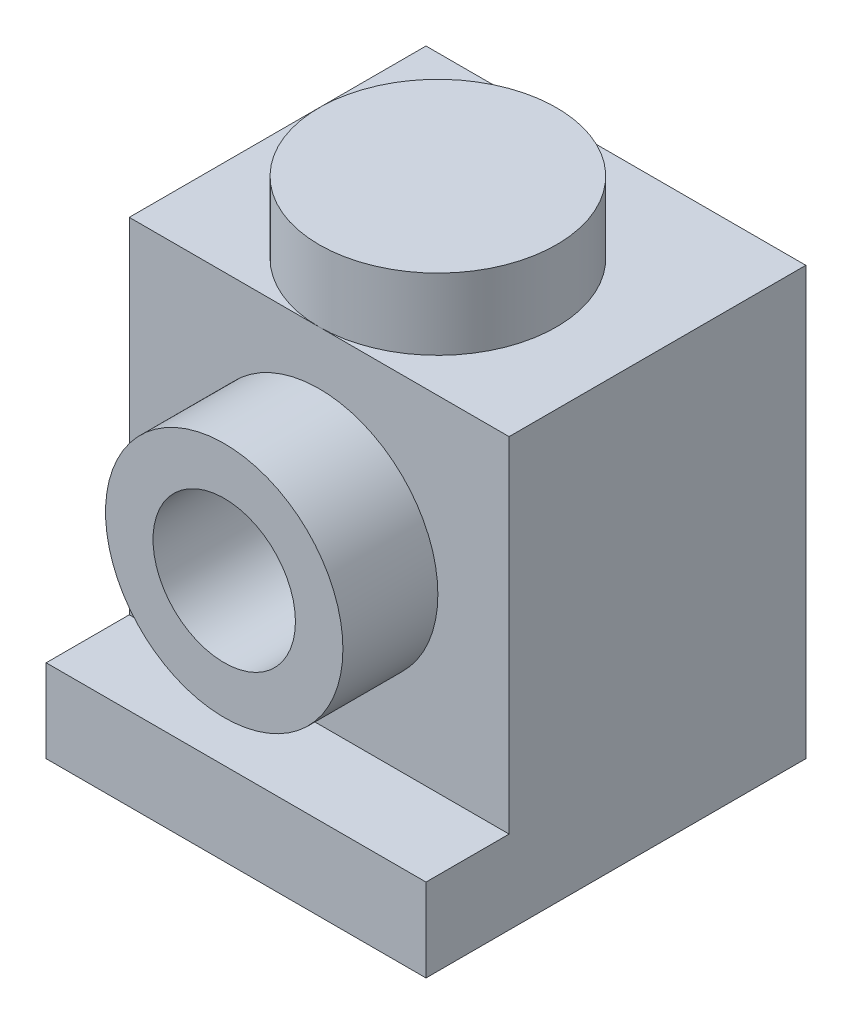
ISO-10303-21;
HEADER;
FILE_DESCRIPTION(('STEP AP214'),'2;1');
FILE_NAME('part.step','',(''),(''),'','','');
FILE_SCHEMA(('AUTOMOTIVE_DESIGN { 1 0 10303 214 1 1 1 1 }'));
ENDSEC;
DATA;
#1=APPLICATION_CONTEXT('core data for automotive mechanical design processes');
#2=APPLICATION_PROTOCOL_DEFINITION('international standard','automotive_design',2000,#1);
#3=PRODUCT_CONTEXT('',#1,'mechanical');
#4=PRODUCT('Part','Part','',(#3));
#5=PRODUCT_RELATED_PRODUCT_CATEGORY('part','',(#4));
#6=PRODUCT_DEFINITION_FORMATION('','',#4);
#7=PRODUCT_DEFINITION_CONTEXT('part definition',#1,'design');
#8=PRODUCT_DEFINITION('design','',#6,#7);
#9=PRODUCT_DEFINITION_SHAPE('','',#8);
#10=(LENGTH_UNIT() NAMED_UNIT(*) SI_UNIT(.MILLI.,.METRE.));
#11=(NAMED_UNIT(*) PLANE_ANGLE_UNIT() SI_UNIT($,.RADIAN.));
#12=(NAMED_UNIT(*) SI_UNIT($,.STERADIAN.) SOLID_ANGLE_UNIT());
#13=UNCERTAINTY_MEASURE_WITH_UNIT(LENGTH_MEASURE(1.E-05),#10,'distance_accuracy_value','');
#14=(GEOMETRIC_REPRESENTATION_CONTEXT(3) GLOBAL_UNCERTAINTY_ASSIGNED_CONTEXT((#13)) GLOBAL_UNIT_ASSIGNED_CONTEXT((#10,
#11,#12)) REPRESENTATION_CONTEXT('',''));
#15=CARTESIAN_POINT('',(0.,0.,0.));
#16=DIRECTION('',(0.,0.,1.));
#17=DIRECTION('',(1.,0.,0.));
#18=AXIS2_PLACEMENT_3D('',#15,#16,#17);
#19=CARTESIAN_POINT('',(-1.5,1.,-6.5));
#20=DIRECTION('',(0.,1.,0.));
#21=DIRECTION('',(0.,0.,1.));
#22=AXIS2_PLACEMENT_3D('',#19,#20,#21);
#23=PLANE('',#22);
#24=DIRECTION('',(-1.,0.,0.));
#25=VECTOR('',#24,1.);
#26=CARTESIAN_POINT('',(-1.5,1.,-1.5));
#27=LINE('',#26,#25);
#28=CARTESIAN_POINT('',(-1.5,1.,-1.5));
#29=VERTEX_POINT('',#28);
#30=CARTESIAN_POINT('',(-4.,1.,-1.5));
#31=VERTEX_POINT('',#30);
#32=EDGE_CURVE('E245',#29,#31,#27,.T.);
#33=ORIENTED_EDGE('',*,*,#32,.T.);
#34=CARTESIAN_POINT('',(-4.,1.,-8.00000000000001));
#35=DIRECTION('',(0.,-1.,0.));
#36=DIRECTION('',(0.,0.,-1.));
#37=AXIS2_PLACEMENT_3D('',#34,#35,#36);
#38=CIRCLE('',#37,6.50000000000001);
#39=CARTESIAN_POINT('',(-1.5,1.,-2.));
#40=VERTEX_POINT('',#39);
#41=EDGE_CURVE('E222',#40,#31,#38,.T.);
#42=ORIENTED_EDGE('',*,*,#41,.F.);
#43=DIRECTION('',(0.,0.,1.));
#44=VECTOR('',#43,1.);
#45=CARTESIAN_POINT('',(-1.5,1.,-1.5));
#46=LINE('',#45,#44);
#47=EDGE_CURVE('E244',#40,#29,#46,.T.);
#48=ORIENTED_EDGE('',*,*,#47,.T.);
#49=EDGE_LOOP('',(#33,#42,#48));
#50=FACE_BOUND('',#49,.T.);
#51=ADVANCED_FACE('F32',(#50),#23,.F.);
#52=DIRECTION('',(0.,0.,-1.));
#53=VECTOR('',#52,1.);
#54=CARTESIAN_POINT('',(-6.5,1.,-1.5));
#55=LINE('',#54,#53);
#56=CARTESIAN_POINT('',(-6.5,1.,-1.5));
#57=VERTEX_POINT('',#56);
#58=CARTESIAN_POINT('',(-6.5,1.,-2.));
#59=VERTEX_POINT('',#58);
#60=EDGE_CURVE('E249',#57,#59,#55,.T.);
#61=ORIENTED_EDGE('',*,*,#60,.T.);
#62=EDGE_CURVE('E224',#31,#59,#38,.T.);
#63=ORIENTED_EDGE('',*,*,#62,.F.);
#64=EDGE_CURVE('E243',#31,#57,#27,.T.);
#65=ORIENTED_EDGE('',*,*,#64,.T.);
#66=EDGE_LOOP('',(#61,#63,#65));
#67=FACE_BOUND('',#66,.T.);
#68=ADVANCED_FACE('F403',(#67),#23,.F.);
#69=CARTESIAN_POINT('',(-4.,1.,0.));
#70=DIRECTION('',(0.,-1.,0.));
#71=DIRECTION('',(0.,0.,-1.));
#72=AXIS2_PLACEMENT_3D('',#69,#70,#71);
#73=CIRCLE('',#72,6.50000000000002);
#74=CARTESIAN_POINT('',(-6.5,1.,-6.));
#75=VERTEX_POINT('',#74);
#76=CARTESIAN_POINT('',(-4.,1.,-6.5));
#77=VERTEX_POINT('',#76);
#78=EDGE_CURVE('E43',#75,#77,#73,.T.);
#79=ORIENTED_EDGE('',*,*,#78,.F.);
#80=CARTESIAN_POINT('',(-6.5,1.,-6.5));
#81=VERTEX_POINT('',#80);
#82=EDGE_CURVE('E248',#75,#81,#55,.T.);
#83=ORIENTED_EDGE('',*,*,#82,.T.);
#84=DIRECTION('',(1.,0.,0.));
#85=VECTOR('',#84,1.);
#86=CARTESIAN_POINT('',(-1.5,1.,-6.5));
#87=LINE('',#86,#85);
#88=EDGE_CURVE('E254',#81,#77,#87,.T.);
#89=ORIENTED_EDGE('',*,*,#88,.T.);
#90=EDGE_LOOP('',(#79,#83,#89));
#91=FACE_BOUND('',#90,.T.);
#92=ADVANCED_FACE('F406',(#91),#23,.F.);
#93=CARTESIAN_POINT('',(-1.5,1.,-6.));
#94=VERTEX_POINT('',#93);
#95=EDGE_CURVE('E11',#77,#94,#73,.T.);
#96=ORIENTED_EDGE('',*,*,#95,.F.);
#97=CARTESIAN_POINT('',(-1.5,1.,-6.5));
#98=VERTEX_POINT('',#97);
#99=EDGE_CURVE('E252',#77,#98,#87,.T.);
#100=ORIENTED_EDGE('',*,*,#99,.T.);
#101=EDGE_CURVE('E240',#98,#94,#46,.T.);
#102=ORIENTED_EDGE('',*,*,#101,.T.);
#103=EDGE_LOOP('',(#96,#100,#102));
#104=FACE_BOUND('',#103,.T.);
#105=ADVANCED_FACE('F411',(#104),#23,.F.);
#106=CARTESIAN_POINT('',(-6.5,1.,-2.01409571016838));
#107=VERTEX_POINT('',#106);
#108=EDGE_CURVE('E253',#59,#107,#55,.T.);
#109=ORIENTED_EDGE('',*,*,#108,.T.);
#110=DIRECTION('',(-1.,0.,0.));
#111=VECTOR('',#110,1.);
#112=CARTESIAN_POINT('',(-1.5,1.,-2.01409571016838));
#113=LINE('',#112,#111);
#114=CARTESIAN_POINT('',(-1.5,1.,-2.01409571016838));
#115=VERTEX_POINT('',#114);
#116=EDGE_CURVE('E202',#115,#107,#113,.T.);
#117=ORIENTED_EDGE('',*,*,#116,.F.);
#118=EDGE_CURVE('E194',#115,#40,#46,.T.);
#119=ORIENTED_EDGE('',*,*,#118,.T.);
#120=DIRECTION('',(1.,0.,0.));
#121=VECTOR('',#120,1.);
#122=CARTESIAN_POINT('',(-1.5,1.,-2.));
#123=LINE('',#122,#121);
#124=EDGE_CURVE('E219',#59,#40,#123,.T.);
#125=ORIENTED_EDGE('',*,*,#124,.F.);
#126=EDGE_LOOP('',(#109,#117,#119,#125));
#127=FACE_BOUND('',#126,.T.);
#128=ADVANCED_FACE('F380',(#127),#23,.F.);
#129=CARTESIAN_POINT('',(-8.,9.,-1.75));
#130=DIRECTION('',(0.,0.,1.));
#131=DIRECTION('',(1.,0.,0.));
#132=AXIS2_PLACEMENT_3D('',#129,#130,#131);
#133=PLANE('',#132);
#134=DIRECTION('',(0.,-1.,0.));
#135=VECTOR('',#134,1.);
#136=CARTESIAN_POINT('',(0.,9.,-1.75));
#137=LINE('',#136,#135);
#138=CARTESIAN_POINT('',(0.,9.,-1.75));
#139=VERTEX_POINT('',#138);
#140=CARTESIAN_POINT('',(0.,1.75,-1.75));
#141=VERTEX_POINT('',#140);
#142=EDGE_CURVE('E335',#139,#141,#137,.T.);
#143=ORIENTED_EDGE('',*,*,#142,.F.);
#144=DIRECTION('',(1.,0.,0.));
#145=VECTOR('',#144,1.);
#146=CARTESIAN_POINT('',(-8.,9.,-1.75));
#147=LINE('',#146,#145);
#148=CARTESIAN_POINT('',(-4.,9.,-1.75));
#149=VERTEX_POINT('',#148);
#150=EDGE_CURVE('E345',#149,#139,#147,.T.);
#151=ORIENTED_EDGE('',*,*,#150,.F.);
#152=CARTESIAN_POINT('',(-8.,9.,-1.75));
#153=VERTEX_POINT('',#152);
#154=EDGE_CURVE('E343',#153,#149,#147,.T.);
#155=ORIENTED_EDGE('',*,*,#154,.F.);
#156=DIRECTION('',(0.,-1.,0.));
#157=VECTOR('',#156,1.);
#158=CARTESIAN_POINT('',(-8.,9.,-1.75));
#159=LINE('',#158,#157);
#160=CARTESIAN_POINT('',(-8.,1.75,-1.75));
#161=VERTEX_POINT('',#160);
#162=EDGE_CURVE('E317',#153,#161,#159,.T.);
#163=ORIENTED_EDGE('',*,*,#162,.T.);
#164=DIRECTION('',(1.,0.,0.));
#165=VECTOR('',#164,1.);
#166=CARTESIAN_POINT('',(-8.,1.75,-1.75));
#167=LINE('',#166,#165);
#168=EDGE_CURVE('E341',#161,#141,#167,.T.);
#169=ORIENTED_EDGE('',*,*,#168,.T.);
#170=EDGE_LOOP('',(#143,#151,#155,#163,#169));
#171=FACE_BOUND('',#170,.T.);
#172=CARTESIAN_POINT('',(-4.,5.375,-1.75));
#173=DIRECTION('',(0.,0.,1.));
#174=DIRECTION('',(1.,0.,0.));
#175=AXIS2_PLACEMENT_3D('',#172,#173,#174);
#176=CIRCLE('',#175,2.5);
#177=CARTESIAN_POINT('',(-1.5,5.375,-1.75));
#178=VERTEX_POINT('',#177);
#179=EDGE_CURVE('E278',#178,#178,#176,.T.);
#180=ORIENTED_EDGE('',*,*,#179,.F.);
#181=EDGE_LOOP('',(#180));
#182=FACE_BOUND('',#181,.T.);
#183=ADVANCED_FACE('F377',(#171,#182),#133,.T.);
#184=CARTESIAN_POINT('',(-8.,1.75,0.));
#185=DIRECTION('',(0.,0.,1.));
#186=DIRECTION('',(0.,-1.,0.));
#187=AXIS2_PLACEMENT_3D('',#184,#185,#186);
#188=PLANE('',#187);
#189=DIRECTION('',(0.,-1.,0.));
#190=VECTOR('',#189,1.);
#191=CARTESIAN_POINT('',(0.,1.75,0.));
#192=LINE('',#191,#190);
#193=CARTESIAN_POINT('',(0.,1.75,0.));
#194=VERTEX_POINT('',#193);
#195=CARTESIAN_POINT('',(0.,0.,0.));
#196=VERTEX_POINT('',#195);
#197=EDGE_CURVE('E301',#194,#196,#192,.T.);
#198=ORIENTED_EDGE('',*,*,#197,.F.);
#199=DIRECTION('',(1.,0.,0.));
#200=VECTOR('',#199,1.);
#201=CARTESIAN_POINT('',(-8.,1.75,0.));
#202=LINE('',#201,#200);
#203=CARTESIAN_POINT('',(-8.,1.75,0.));
#204=VERTEX_POINT('',#203);
#205=EDGE_CURVE('E41',#204,#194,#202,.T.);
#206=ORIENTED_EDGE('',*,*,#205,.F.);
#207=DIRECTION('',(0.,-1.,0.));
#208=VECTOR('',#207,1.);
#209=CARTESIAN_POINT('',(-8.,1.75,0.));
#210=LINE('',#209,#208);
#211=CARTESIAN_POINT('',(-8.,0.,0.));
#212=VERTEX_POINT('',#211);
#213=EDGE_CURVE('E304',#204,#212,#210,.T.);
#214=ORIENTED_EDGE('',*,*,#213,.T.);
#215=DIRECTION('',(1.,0.,0.));
#216=VECTOR('',#215,1.);
#217=CARTESIAN_POINT('',(-8.,0.,0.));
#218=LINE('',#217,#216);
#219=EDGE_CURVE('E323',#212,#196,#218,.T.);
#220=ORIENTED_EDGE('',*,*,#219,.T.);
#221=EDGE_LOOP('',(#198,#206,#214,#220));
#222=FACE_BOUND('',#221,.T.);
#223=ADVANCED_FACE('F34',(#222),#188,.T.);
#224=CARTESIAN_POINT('',(-8.,1.75,-1.75));
#225=DIRECTION('',(0.,1.,0.));
#226=DIRECTION('',(0.,0.,1.));
#227=AXIS2_PLACEMENT_3D('',#224,#225,#226);
#228=PLANE('',#227);
#229=DIRECTION('',(0.,0.,1.));
#230=VECTOR('',#229,1.);
#231=CARTESIAN_POINT('',(0.,1.75,-1.75));
#232=LINE('',#231,#230);
#233=EDGE_CURVE('E308',#141,#194,#232,.T.);
#234=ORIENTED_EDGE('',*,*,#233,.F.);
#235=ORIENTED_EDGE('',*,*,#168,.F.);
#236=DIRECTION('',(0.,0.,1.));
#237=VECTOR('',#236,1.);
#238=CARTESIAN_POINT('',(-8.,1.75,-1.75));
#239=LINE('',#238,#237);
#240=EDGE_CURVE('E320',#161,#204,#239,.T.);
#241=ORIENTED_EDGE('',*,*,#240,.T.);
#242=ORIENTED_EDGE('',*,*,#205,.T.);
#243=EDGE_LOOP('',(#234,#235,#241,#242));
#244=FACE_BOUND('',#243,.T.);
#245=ADVANCED_FACE('F362',(#244),#228,.T.);
#246=CARTESIAN_POINT('',(-8.,9.,-8.));
#247=DIRECTION('',(0.,1.,0.));
#248=DIRECTION('',(0.,0.,1.));
#249=AXIS2_PLACEMENT_3D('',#246,#247,#248);
#250=PLANE('',#249);
#251=ORIENTED_EDGE('',*,*,#154,.T.);
#252=CARTESIAN_POINT('',(-4.,9.,-4.25));
#253=DIRECTION('',(0.,1.,0.));
#254=DIRECTION('',(0.,0.,1.));
#255=AXIS2_PLACEMENT_3D('',#252,#253,#254);
#256=CIRCLE('',#255,2.5);
#257=EDGE_CURVE('E186',#149,#149,#256,.T.);
#258=ORIENTED_EDGE('',*,*,#257,.F.);
#259=ORIENTED_EDGE('',*,*,#150,.T.);
#260=DIRECTION('',(0.,0.,1.));
#261=VECTOR('',#260,1.);
#262=CARTESIAN_POINT('',(0.,9.,-8.));
#263=LINE('',#262,#261);
#264=CARTESIAN_POINT('',(0.,9.,-8.));
#265=VERTEX_POINT('',#264);
#266=EDGE_CURVE('E332',#265,#139,#263,.T.);
#267=ORIENTED_EDGE('',*,*,#266,.F.);
#268=DIRECTION('',(1.,0.,0.));
#269=VECTOR('',#268,1.);
#270=CARTESIAN_POINT('',(-8.,9.,-8.));
#271=LINE('',#270,#269);
#272=CARTESIAN_POINT('',(-8.,9.,-8.));
#273=VERTEX_POINT('',#272);
#274=EDGE_CURVE('E346',#273,#265,#271,.T.);
#275=ORIENTED_EDGE('',*,*,#274,.F.);
#276=DIRECTION('',(0.,0.,1.));
#277=VECTOR('',#276,1.);
#278=CARTESIAN_POINT('',(-8.,9.,-8.));
#279=LINE('',#278,#277);
#280=EDGE_CURVE('E314',#273,#153,#279,.T.);
#281=ORIENTED_EDGE('',*,*,#280,.T.);
#282=EDGE_LOOP('',(#251,#258,#259,#267,#275,#281));
#283=FACE_BOUND('',#282,.T.);
#284=ADVANCED_FACE('F373',(#283),#250,.T.);
#285=CARTESIAN_POINT('',(-8.,0.,-8.));
#286=DIRECTION('',(0.,0.,-1.));
#287=DIRECTION('',(0.,1.,0.));
#288=AXIS2_PLACEMENT_3D('',#285,#286,#287);
#289=PLANE('',#288);
#290=DIRECTION('',(0.,-1.,0.));
#291=VECTOR('',#290,1.);
#292=CARTESIAN_POINT('',(-1.5,7.5,-8.));
#293=LINE('',#292,#291);
#294=CARTESIAN_POINT('',(-1.5,7.5,-8.));
#295=VERTEX_POINT('',#294);
#296=CARTESIAN_POINT('',(-1.5,2.5,-8.));
#297=VERTEX_POINT('',#296);
#298=EDGE_CURVE('E282',#295,#297,#293,.T.);
#299=ORIENTED_EDGE('',*,*,#298,.F.);
#300=DIRECTION('',(1.,0.,0.));
#301=VECTOR('',#300,1.);
#302=CARTESIAN_POINT('',(-1.5,7.5,-8.));
#303=LINE('',#302,#301);
#304=CARTESIAN_POINT('',(-6.5,7.5,-8.));
#305=VERTEX_POINT('',#304);
#306=EDGE_CURVE('E183',#305,#295,#303,.T.);
#307=ORIENTED_EDGE('',*,*,#306,.F.);
#308=DIRECTION('',(0.,1.,0.));
#309=VECTOR('',#308,1.);
#310=CARTESIAN_POINT('',(-6.5,7.5,-8.));
#311=LINE('',#310,#309);
#312=CARTESIAN_POINT('',(-6.5,2.5,-8.));
#313=VERTEX_POINT('',#312);
#314=EDGE_CURVE('E289',#313,#305,#311,.T.);
#315=ORIENTED_EDGE('',*,*,#314,.F.);
#316=DIRECTION('',(-1.,0.,0.));
#317=VECTOR('',#316,1.);
#318=CARTESIAN_POINT('',(-1.5,2.5,-8.));
#319=LINE('',#318,#317);
#320=EDGE_CURVE('E286',#297,#313,#319,.T.);
#321=ORIENTED_EDGE('',*,*,#320,.F.);
#322=EDGE_LOOP('',(#299,#307,#315,#321));
#323=FACE_BOUND('',#322,.T.);
#324=DIRECTION('',(0.,1.,0.));
#325=VECTOR('',#324,1.);
#326=CARTESIAN_POINT('',(0.,0.,-8.));
#327=LINE('',#326,#325);
#328=CARTESIAN_POINT('',(0.,0.,-8.));
#329=VERTEX_POINT('',#328);
#330=EDGE_CURVE('E329',#329,#265,#327,.T.);
#331=ORIENTED_EDGE('',*,*,#330,.F.);
#332=DIRECTION('',(1.,0.,0.));
#333=VECTOR('',#332,1.);
#334=CARTESIAN_POINT('',(-8.,0.,-8.));
#335=LINE('',#334,#333);
#336=CARTESIAN_POINT('',(-8.,0.,-8.));
#337=VERTEX_POINT('',#336);
#338=EDGE_CURVE('E348',#337,#329,#335,.T.);
#339=ORIENTED_EDGE('',*,*,#338,.F.);
#340=DIRECTION('',(0.,1.,0.));
#341=VECTOR('',#340,1.);
#342=CARTESIAN_POINT('',(-8.,0.,-8.));
#343=LINE('',#342,#341);
#344=EDGE_CURVE('E311',#337,#273,#343,.T.);
#345=ORIENTED_EDGE('',*,*,#344,.T.);
#346=ORIENTED_EDGE('',*,*,#274,.T.);
#347=EDGE_LOOP('',(#331,#339,#345,#346));
#348=FACE_BOUND('',#347,.T.);
#349=ADVANCED_FACE('F370',(#323,#348),#289,.T.);
#350=CARTESIAN_POINT('',(-8.,0.,0.));
#351=DIRECTION('',(0.,-1.,0.));
#352=DIRECTION('',(0.,0.,-1.));
#353=AXIS2_PLACEMENT_3D('',#350,#351,#352);
#354=PLANE('',#353);
#355=DIRECTION('',(0.,0.,1.));
#356=VECTOR('',#355,1.);
#357=CARTESIAN_POINT('',(-1.5,0.,-1.5));
#358=LINE('',#357,#356);
#359=CARTESIAN_POINT('',(-1.5,0.,-6.5));
#360=VERTEX_POINT('',#359);
#361=CARTESIAN_POINT('',(-1.5,0.,-1.5));
#362=VERTEX_POINT('',#361);
#363=EDGE_CURVE('E58',#360,#362,#358,.T.);
#364=ORIENTED_EDGE('',*,*,#363,.F.);
#365=DIRECTION('',(1.,0.,0.));
#366=VECTOR('',#365,1.);
#367=CARTESIAN_POINT('',(-1.5,0.,-6.5));
#368=LINE('',#367,#366);
#369=CARTESIAN_POINT('',(-6.5,0.,-6.5));
#370=VERTEX_POINT('',#369);
#371=EDGE_CURVE('E265',#370,#360,#368,.T.);
#372=ORIENTED_EDGE('',*,*,#371,.F.);
#373=DIRECTION('',(0.,0.,-1.));
#374=VECTOR('',#373,1.);
#375=CARTESIAN_POINT('',(-6.5,0.,-1.5));
#376=LINE('',#375,#374);
#377=CARTESIAN_POINT('',(-6.5,0.,-1.5));
#378=VERTEX_POINT('',#377);
#379=EDGE_CURVE('E262',#378,#370,#376,.T.);
#380=ORIENTED_EDGE('',*,*,#379,.F.);
#381=DIRECTION('',(-1.,0.,0.));
#382=VECTOR('',#381,1.);
#383=CARTESIAN_POINT('',(-1.5,0.,-1.5));
#384=LINE('',#383,#382);
#385=EDGE_CURVE('E259',#362,#378,#384,.T.);
#386=ORIENTED_EDGE('',*,*,#385,.F.);
#387=EDGE_LOOP('',(#364,#372,#380,#386));
#388=FACE_BOUND('',#387,.T.);
#389=DIRECTION('',(0.,0.,-1.));
#390=VECTOR('',#389,1.);
#391=CARTESIAN_POINT('',(0.,0.,0.));
#392=LINE('',#391,#390);
#393=EDGE_CURVE('E326',#196,#329,#392,.T.);
#394=ORIENTED_EDGE('',*,*,#393,.F.);
#395=ORIENTED_EDGE('',*,*,#219,.F.);
#396=DIRECTION('',(0.,0.,-1.));
#397=VECTOR('',#396,1.);
#398=CARTESIAN_POINT('',(-8.,0.,0.));
#399=LINE('',#398,#397);
#400=EDGE_CURVE('E307',#212,#337,#399,.T.);
#401=ORIENTED_EDGE('',*,*,#400,.T.);
#402=ORIENTED_EDGE('',*,*,#338,.T.);
#403=EDGE_LOOP('',(#394,#395,#401,#402));
#404=FACE_BOUND('',#403,.T.);
#405=ADVANCED_FACE('F355',(#388,#404),#354,.T.);
#406=CARTESIAN_POINT('',(-8.,1.75,0.));
#407=DIRECTION('',(-1.,0.,0.));
#408=DIRECTION('',(0.,0.,1.));
#409=AXIS2_PLACEMENT_3D('',#406,#407,#408);
#410=PLANE('',#409);
#411=ORIENTED_EDGE('',*,*,#213,.F.);
#412=ORIENTED_EDGE('',*,*,#240,.F.);
#413=ORIENTED_EDGE('',*,*,#162,.F.);
#414=ORIENTED_EDGE('',*,*,#280,.F.);
#415=ORIENTED_EDGE('',*,*,#344,.F.);
#416=ORIENTED_EDGE('',*,*,#400,.F.);
#417=EDGE_LOOP('',(#411,#412,#413,#414,#415,#416));
#418=FACE_BOUND('',#417,.T.);
#419=ADVANCED_FACE('F365',(#418),#410,.T.);
#420=CARTESIAN_POINT('',(0.,1.75,0.));
#421=DIRECTION('',(-1.,0.,0.));
#422=DIRECTION('',(0.,0.,1.));
#423=AXIS2_PLACEMENT_3D('',#420,#421,#422);
#424=PLANE('',#423);
#425=ORIENTED_EDGE('',*,*,#197,.T.);
#426=ORIENTED_EDGE('',*,*,#393,.T.);
#427=ORIENTED_EDGE('',*,*,#330,.T.);
#428=ORIENTED_EDGE('',*,*,#266,.T.);
#429=ORIENTED_EDGE('',*,*,#142,.T.);
#430=ORIENTED_EDGE('',*,*,#233,.T.);
#431=EDGE_LOOP('',(#425,#426,#427,#428,#429,#430));
#432=FACE_BOUND('',#431,.T.);
#433=ADVANCED_FACE('F358',(#432),#424,.F.);
#434=CARTESIAN_POINT('',(-4.,10.5,-4.25));
#435=DIRECTION('',(0.,-1.,0.));
#436=DIRECTION('',(0.,0.,-1.));
#437=AXIS2_PLACEMENT_3D('',#434,#435,#436);
#438=CYLINDRICAL_SURFACE('',#437,2.5);
#439=CARTESIAN_POINT('',(-4.,10.5,-4.25));
#440=DIRECTION('',(0.,1.,0.));
#441=DIRECTION('',(0.,0.,1.));
#442=AXIS2_PLACEMENT_3D('',#439,#440,#441);
#443=CIRCLE('',#442,2.5);
#444=CARTESIAN_POINT('',(-4.,10.5,-1.75));
#445=VERTEX_POINT('',#444);
#446=EDGE_CURVE('E298',#445,#445,#443,.T.);
#447=ORIENTED_EDGE('',*,*,#446,.F.);
#448=EDGE_LOOP('',(#447));
#449=FACE_BOUND('',#448,.T.);
#450=ORIENTED_EDGE('',*,*,#257,.T.);
#451=EDGE_LOOP('',(#450));
#452=FACE_BOUND('',#451,.T.);
#453=ADVANCED_FACE('F631',(#449,#452),#438,.T.);
#454=CARTESIAN_POINT('',(-4.,10.5,-4.25));
#455=DIRECTION('',(0.,1.,0.));
#456=DIRECTION('',(0.,0.,1.));
#457=AXIS2_PLACEMENT_3D('',#454,#455,#456);
#458=PLANE('',#457);
#459=ORIENTED_EDGE('',*,*,#446,.T.);
#460=EDGE_LOOP('',(#459));
#461=FACE_BOUND('',#460,.T.);
#462=ADVANCED_FACE('F521',(#461),#458,.T.);
#463=CARTESIAN_POINT('',(-1.5,7.5,-2.25));
#464=DIRECTION('',(1.,0.,0.));
#465=DIRECTION('',(0.,1.,0.));
#466=AXIS2_PLACEMENT_3D('',#463,#464,#465);
#467=PLANE('',#466);
#468=DIRECTION('',(0.,0.,-1.));
#469=VECTOR('',#468,1.);
#470=CARTESIAN_POINT('',(-1.5,2.5,-2.25));
#471=LINE('',#470,#469);
#472=CARTESIAN_POINT('',(-1.5,2.5,-6.));
#473=VERTEX_POINT('',#472);
#474=EDGE_CURVE('E292',#473,#297,#471,.T.);
#475=ORIENTED_EDGE('',*,*,#474,.F.);
#476=DIRECTION('',(0.,-1.,0.));
#477=VECTOR('',#476,1.);
#478=CARTESIAN_POINT('',(-1.5,7.5,-6.));
#479=LINE('',#478,#477);
#480=CARTESIAN_POINT('',(-1.5,1.25,-6.));
#481=VERTEX_POINT('',#480);
#482=EDGE_CURVE('E206',#473,#481,#479,.T.);
#483=ORIENTED_EDGE('',*,*,#482,.T.);
#484=DIRECTION('',(0.,-1.,0.));
#485=VECTOR('',#484,1.);
#486=CARTESIAN_POINT('',(-1.5,1.25,-6.));
#487=LINE('',#486,#485);
#488=EDGE_CURVE('E235',#481,#94,#487,.T.);
#489=ORIENTED_EDGE('',*,*,#488,.T.);
#490=ORIENTED_EDGE('',*,*,#101,.F.);
#491=DIRECTION('',(0.,-1.,0.));
#492=VECTOR('',#491,1.);
#493=CARTESIAN_POINT('',(-1.5,1.,-6.5));
#494=LINE('',#493,#492);
#495=EDGE_CURVE('E268',#98,#360,#494,.T.);
#496=ORIENTED_EDGE('',*,*,#495,.T.);
#497=ORIENTED_EDGE('',*,*,#363,.T.);
#498=DIRECTION('',(0.,-1.,0.));
#499=VECTOR('',#498,1.);
#500=CARTESIAN_POINT('',(-1.5,1.,-1.5));
#501=LINE('',#500,#499);
#502=EDGE_CURVE('E257',#29,#362,#501,.T.);
#503=ORIENTED_EDGE('',*,*,#502,.F.);
#504=ORIENTED_EDGE('',*,*,#47,.F.);
#505=ORIENTED_EDGE('',*,*,#118,.F.);
#506=DIRECTION('',(0.,-1.,0.));
#507=VECTOR('',#506,1.);
#508=CARTESIAN_POINT('',(-1.5,7.5,-2.01409571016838));
#509=LINE('',#508,#507);
#510=CARTESIAN_POINT('',(-1.5,7.5,-2.01409571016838));
#511=VERTEX_POINT('',#510);
#512=EDGE_CURVE('E190',#511,#115,#509,.T.);
#513=ORIENTED_EDGE('',*,*,#512,.F.);
#514=DIRECTION('',(0.,0.,-1.));
#515=VECTOR('',#514,1.);
#516=CARTESIAN_POINT('',(-1.5,7.5,-2.25));
#517=LINE('',#516,#515);
#518=EDGE_CURVE('E177',#511,#295,#517,.T.);
#519=ORIENTED_EDGE('',*,*,#518,.T.);
#520=ORIENTED_EDGE('',*,*,#298,.T.);
#521=EDGE_LOOP('',(#475,#483,#489,#490,#496,#497,#503,#504,#505,#513,#519,#520));
#522=FACE_BOUND('',#521,.T.);
#523=ADVANCED_FACE('F192',(#522),#467,.F.);
#524=CARTESIAN_POINT('',(-1.5,7.5,-2.25));
#525=DIRECTION('',(0.,1.,0.));
#526=DIRECTION('',(0.,0.,1.));
#527=AXIS2_PLACEMENT_3D('',#524,#525,#526);
#528=PLANE('',#527);
#529=ORIENTED_EDGE('',*,*,#306,.T.);
#530=ORIENTED_EDGE('',*,*,#518,.F.);
#531=DIRECTION('',(-1.,0.,0.));
#532=VECTOR('',#531,1.);
#533=CARTESIAN_POINT('',(-1.5,7.5,-2.01409571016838));
#534=LINE('',#533,#532);
#535=CARTESIAN_POINT('',(-6.5,7.5,-2.01409571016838));
#536=VERTEX_POINT('',#535);
#537=EDGE_CURVE('E181',#511,#536,#534,.T.);
#538=ORIENTED_EDGE('',*,*,#537,.T.);
#539=DIRECTION('',(0.,0.,-1.));
#540=VECTOR('',#539,1.);
#541=CARTESIAN_POINT('',(-6.5,7.5,-2.25));
#542=LINE('',#541,#540);
#543=EDGE_CURVE('E187',#536,#305,#542,.T.);
#544=ORIENTED_EDGE('',*,*,#543,.T.);
#545=EDGE_LOOP('',(#529,#530,#538,#544));
#546=FACE_BOUND('',#545,.T.);
#547=ADVANCED_FACE('F179',(#546),#528,.F.);
#548=CARTESIAN_POINT('',(-6.5,7.5,-2.25));
#549=DIRECTION('',(-1.,0.,0.));
#550=DIRECTION('',(0.,-1.,0.));
#551=AXIS2_PLACEMENT_3D('',#548,#549,#550);
#552=PLANE('',#551);
#553=ORIENTED_EDGE('',*,*,#314,.T.);
#554=ORIENTED_EDGE('',*,*,#543,.F.);
#555=DIRECTION('',(0.,-1.,0.));
#556=VECTOR('',#555,1.);
#557=CARTESIAN_POINT('',(-6.5,7.5,-2.01409571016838));
#558=LINE('',#557,#556);
#559=EDGE_CURVE('E198',#536,#107,#558,.T.);
#560=ORIENTED_EDGE('',*,*,#559,.T.);
#561=ORIENTED_EDGE('',*,*,#108,.F.);
#562=ORIENTED_EDGE('',*,*,#60,.F.);
#563=DIRECTION('',(0.,-1.,0.));
#564=VECTOR('',#563,1.);
#565=CARTESIAN_POINT('',(-6.5,1.,-1.5));
#566=LINE('',#565,#564);
#567=EDGE_CURVE('E273',#57,#378,#566,.T.);
#568=ORIENTED_EDGE('',*,*,#567,.T.);
#569=ORIENTED_EDGE('',*,*,#379,.T.);
#570=DIRECTION('',(0.,-1.,0.));
#571=VECTOR('',#570,1.);
#572=CARTESIAN_POINT('',(-6.5,1.,-6.5));
#573=LINE('',#572,#571);
#574=EDGE_CURVE('E271',#81,#370,#573,.T.);
#575=ORIENTED_EDGE('',*,*,#574,.F.);
#576=ORIENTED_EDGE('',*,*,#82,.F.);
#577=DIRECTION('',(0.,-1.,0.));
#578=VECTOR('',#577,1.);
#579=CARTESIAN_POINT('',(-6.5,1.25,-6.));
#580=LINE('',#579,#578);
#581=CARTESIAN_POINT('',(-6.5,1.25,-6.));
#582=VERTEX_POINT('',#581);
#583=EDGE_CURVE('E237',#582,#75,#580,.T.);
#584=ORIENTED_EDGE('',*,*,#583,.F.);
#585=DIRECTION('',(0.,-1.,0.));
#586=VECTOR('',#585,1.);
#587=CARTESIAN_POINT('',(-6.5,7.5,-6.));
#588=LINE('',#587,#586);
#589=CARTESIAN_POINT('',(-6.5,2.5,-6.));
#590=VERTEX_POINT('',#589);
#591=EDGE_CURVE('E210',#590,#582,#588,.T.);
#592=ORIENTED_EDGE('',*,*,#591,.F.);
#593=DIRECTION('',(0.,0.,-1.));
#594=VECTOR('',#593,1.);
#595=CARTESIAN_POINT('',(-6.5,2.5,-2.25));
#596=LINE('',#595,#594);
#597=EDGE_CURVE('E295',#590,#313,#596,.T.);
#598=ORIENTED_EDGE('',*,*,#597,.T.);
#599=EDGE_LOOP('',(#553,#554,#560,#561,#562,#568,#569,#575,#576,#584,#592,#598));
#600=FACE_BOUND('',#599,.T.);
#601=ADVANCED_FACE('F434',(#600),#552,.F.);
#602=CARTESIAN_POINT('',(-1.5,2.5,-2.25));
#603=DIRECTION('',(0.,-1.,0.));
#604=DIRECTION('',(0.,0.,-1.));
#605=AXIS2_PLACEMENT_3D('',#602,#603,#604);
#606=PLANE('',#605);
#607=ORIENTED_EDGE('',*,*,#597,.F.);
#608=DIRECTION('',(1.,0.,0.));
#609=VECTOR('',#608,1.);
#610=CARTESIAN_POINT('',(-1.5,2.5,-6.));
#611=LINE('',#610,#609);
#612=EDGE_CURVE('E209',#590,#473,#611,.T.);
#613=ORIENTED_EDGE('',*,*,#612,.T.);
#614=ORIENTED_EDGE('',*,*,#474,.T.);
#615=ORIENTED_EDGE('',*,*,#320,.T.);
#616=EDGE_LOOP('',(#607,#613,#614,#615));
#617=FACE_BOUND('',#616,.T.);
#618=ADVANCED_FACE('F397',(#617),#606,.F.);
#619=CARTESIAN_POINT('',(-4.,5.375,0.25));
#620=DIRECTION('',(0.,0.,1.));
#621=DIRECTION('',(1.,0.,0.));
#622=AXIS2_PLACEMENT_3D('',#619,#620,#621);
#623=PLANE('',#622);
#624=CARTESIAN_POINT('',(-4.,5.375,0.25));
#625=DIRECTION('',(0.,0.,1.));
#626=DIRECTION('',(1.,0.,0.));
#627=AXIS2_PLACEMENT_3D('',#624,#625,#626);
#628=CIRCLE('',#627,2.5);
#629=CARTESIAN_POINT('',(-1.5,5.375,0.25));
#630=VERTEX_POINT('',#629);
#631=EDGE_CURVE('E279',#630,#630,#628,.T.);
#632=ORIENTED_EDGE('',*,*,#631,.T.);
#633=EDGE_LOOP('',(#632));
#634=FACE_BOUND('',#633,.T.);
#635=CARTESIAN_POINT('',(-4.,5.375,0.25));
#636=DIRECTION('',(0.,0.,1.));
#637=DIRECTION('',(1.,0.,0.));
#638=AXIS2_PLACEMENT_3D('',#635,#636,#637);
#639=CIRCLE('',#638,1.5);
#640=CARTESIAN_POINT('',(-2.5,5.375,0.25));
#641=VERTEX_POINT('',#640);
#642=EDGE_CURVE('E270',#641,#641,#639,.T.);
#643=ORIENTED_EDGE('',*,*,#642,.F.);
#644=EDGE_LOOP('',(#643));
#645=FACE_BOUND('',#644,.T.);
#646=ADVANCED_FACE('F387',(#634,#645),#623,.T.);
#647=CARTESIAN_POINT('',(-4.,5.375,0.25));
#648=DIRECTION('',(0.,0.,-1.));
#649=DIRECTION('',(-1.,0.,0.));
#650=AXIS2_PLACEMENT_3D('',#647,#648,#649);
#651=CYLINDRICAL_SURFACE('',#650,2.5);
#652=ORIENTED_EDGE('',*,*,#631,.F.);
#653=EDGE_LOOP('',(#652));
#654=FACE_BOUND('',#653,.T.);
#655=ORIENTED_EDGE('',*,*,#179,.T.);
#656=EDGE_LOOP('',(#655));
#657=FACE_BOUND('',#656,.T.);
#658=ADVANCED_FACE('F384',(#654,#657),#651,.T.);
#659=CARTESIAN_POINT('',(-4.,5.375,0.25));
#660=DIRECTION('',(0.,0.,-1.));
#661=DIRECTION('',(-1.,0.,0.));
#662=AXIS2_PLACEMENT_3D('',#659,#660,#661);
#663=CYLINDRICAL_SURFACE('',#662,1.5);
#664=CARTESIAN_POINT('',(-4.,5.375,-2.01409571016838));
#665=DIRECTION('',(0.,0.,1.));
#666=DIRECTION('',(1.,0.,0.));
#667=AXIS2_PLACEMENT_3D('',#664,#665,#666);
#668=CIRCLE('',#667,1.5);
#669=CARTESIAN_POINT('',(-2.5,5.375,-2.01409571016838));
#670=VERTEX_POINT('',#669);
#671=EDGE_CURVE('E36',#670,#670,#668,.T.);
#672=ORIENTED_EDGE('',*,*,#671,.F.);
#673=EDGE_LOOP('',(#672));
#674=FACE_BOUND('',#673,.T.);
#675=ORIENTED_EDGE('',*,*,#642,.T.);
#676=EDGE_LOOP('',(#675));
#677=FACE_BOUND('',#676,.T.);
#678=ADVANCED_FACE('F386',(#674,#677),#663,.F.);
#679=CARTESIAN_POINT('',(-1.5,1.,-6.5));
#680=DIRECTION('',(0.,0.,-1.));
#681=DIRECTION('',(-1.,0.,0.));
#682=AXIS2_PLACEMENT_3D('',#679,#680,#681);
#683=PLANE('',#682);
#684=ORIENTED_EDGE('',*,*,#371,.T.);
#685=ORIENTED_EDGE('',*,*,#495,.F.);
#686=ORIENTED_EDGE('',*,*,#99,.F.);
#687=ORIENTED_EDGE('',*,*,#88,.F.);
#688=ORIENTED_EDGE('',*,*,#574,.T.);
#689=EDGE_LOOP('',(#684,#685,#686,#687,#688));
#690=FACE_BOUND('',#689,.T.);
#691=ADVANCED_FACE('F394',(#690),#683,.F.);
#692=CARTESIAN_POINT('',(-1.5,1.,-1.5));
#693=DIRECTION('',(0.,0.,1.));
#694=DIRECTION('',(1.,0.,0.));
#695=AXIS2_PLACEMENT_3D('',#692,#693,#694);
#696=PLANE('',#695);
#697=ORIENTED_EDGE('',*,*,#385,.T.);
#698=ORIENTED_EDGE('',*,*,#567,.F.);
#699=ORIENTED_EDGE('',*,*,#64,.F.);
#700=ORIENTED_EDGE('',*,*,#32,.F.);
#701=ORIENTED_EDGE('',*,*,#502,.T.);
#702=EDGE_LOOP('',(#697,#698,#699,#700,#701));
#703=FACE_BOUND('',#702,.T.);
#704=ADVANCED_FACE('F466',(#703),#696,.F.);
#705=CARTESIAN_POINT('',(-4.,1.25,0.));
#706=DIRECTION('',(0.,-1.,0.));
#707=DIRECTION('',(0.,0.,-1.));
#708=AXIS2_PLACEMENT_3D('',#705,#706,#707);
#709=CYLINDRICAL_SURFACE('',#708,6.50000000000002);
#710=ORIENTED_EDGE('',*,*,#78,.T.);
#711=ORIENTED_EDGE('',*,*,#95,.T.);
#712=ORIENTED_EDGE('',*,*,#488,.F.);
#713=CARTESIAN_POINT('',(-4.,1.25,0.));
#714=DIRECTION('',(0.,-1.,0.));
#715=DIRECTION('',(0.,0.,-1.));
#716=AXIS2_PLACEMENT_3D('',#713,#714,#715);
#717=CIRCLE('',#716,6.50000000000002);
#718=EDGE_CURVE('E230',#582,#481,#717,.T.);
#719=ORIENTED_EDGE('',*,*,#718,.F.);
#720=ORIENTED_EDGE('',*,*,#583,.T.);
#721=EDGE_LOOP('',(#710,#711,#712,#719,#720));
#722=FACE_BOUND('',#721,.T.);
#723=ADVANCED_FACE('F444',(#722),#709,.F.);
#724=CARTESIAN_POINT('',(-4.,1.25,0.));
#725=DIRECTION('',(0.,-1.,0.));
#726=DIRECTION('',(0.,0.,-1.));
#727=AXIS2_PLACEMENT_3D('',#724,#725,#726);
#728=PLANE('',#727);
#729=ORIENTED_EDGE('',*,*,#718,.T.);
#730=DIRECTION('',(-1.,0.,0.));
#731=VECTOR('',#730,1.);
#732=CARTESIAN_POINT('',(-1.5,1.25,-6.));
#733=LINE('',#732,#731);
#734=EDGE_CURVE('E233',#481,#582,#733,.T.);
#735=ORIENTED_EDGE('',*,*,#734,.T.);
#736=EDGE_LOOP('',(#729,#735));
#737=FACE_BOUND('',#736,.T.);
#738=ADVANCED_FACE('F455',(#737),#728,.T.);
#739=CARTESIAN_POINT('',(-4.,1.25,-8.00000000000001));
#740=DIRECTION('',(0.,-1.,0.));
#741=DIRECTION('',(0.,0.,-1.));
#742=AXIS2_PLACEMENT_3D('',#739,#740,#741);
#743=CYLINDRICAL_SURFACE('',#742,6.50000000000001);
#744=ORIENTED_EDGE('',*,*,#41,.T.);
#745=ORIENTED_EDGE('',*,*,#62,.T.);
#746=DIRECTION('',(0.,-1.,0.));
#747=VECTOR('',#746,1.);
#748=CARTESIAN_POINT('',(-6.5,1.25,-2.));
#749=LINE('',#748,#747);
#750=CARTESIAN_POINT('',(-6.5,1.25,-2.));
#751=VERTEX_POINT('',#750);
#752=EDGE_CURVE('E50',#751,#59,#749,.T.);
#753=ORIENTED_EDGE('',*,*,#752,.F.);
#754=CARTESIAN_POINT('',(-4.,1.25,-8.00000000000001));
#755=DIRECTION('',(0.,-1.,0.));
#756=DIRECTION('',(0.,0.,-1.));
#757=AXIS2_PLACEMENT_3D('',#754,#755,#756);
#758=CIRCLE('',#757,6.50000000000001);
#759=CARTESIAN_POINT('',(-1.5,1.25,-2.));
#760=VERTEX_POINT('',#759);
#761=EDGE_CURVE('E215',#760,#751,#758,.T.);
#762=ORIENTED_EDGE('',*,*,#761,.F.);
#763=DIRECTION('',(0.,-1.,0.));
#764=VECTOR('',#763,1.);
#765=CARTESIAN_POINT('',(-1.5,1.25,-2.));
#766=LINE('',#765,#764);
#767=EDGE_CURVE('E226',#760,#40,#766,.T.);
#768=ORIENTED_EDGE('',*,*,#767,.T.);
#769=EDGE_LOOP('',(#744,#745,#753,#762,#768));
#770=FACE_BOUND('',#769,.T.);
#771=ADVANCED_FACE('F457',(#770),#743,.F.);
#772=CARTESIAN_POINT('',(-1.5,1.25,-2.));
#773=DIRECTION('',(0.,0.,-1.));
#774=DIRECTION('',(-1.,0.,0.));
#775=AXIS2_PLACEMENT_3D('',#772,#773,#774);
#776=PLANE('',#775);
#777=ORIENTED_EDGE('',*,*,#124,.T.);
#778=ORIENTED_EDGE('',*,*,#767,.F.);
#779=DIRECTION('',(1.,0.,0.));
#780=VECTOR('',#779,1.);
#781=CARTESIAN_POINT('',(-1.5,1.25,-2.));
#782=LINE('',#781,#780);
#783=EDGE_CURVE('E218',#751,#760,#782,.T.);
#784=ORIENTED_EDGE('',*,*,#783,.F.);
#785=ORIENTED_EDGE('',*,*,#752,.T.);
#786=EDGE_LOOP('',(#777,#778,#784,#785));
#787=FACE_BOUND('',#786,.T.);
#788=ADVANCED_FACE('F463',(#787),#776,.F.);
#789=CARTESIAN_POINT('',(-4.,1.25,-8.00000000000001));
#790=DIRECTION('',(0.,-1.,0.));
#791=DIRECTION('',(0.,0.,-1.));
#792=AXIS2_PLACEMENT_3D('',#789,#790,#791);
#793=PLANE('',#792);
#794=ORIENTED_EDGE('',*,*,#761,.T.);
#795=ORIENTED_EDGE('',*,*,#783,.T.);
#796=EDGE_LOOP('',(#794,#795));
#797=FACE_BOUND('',#796,.T.);
#798=ADVANCED_FACE('F470',(#797),#793,.T.);
#799=CARTESIAN_POINT('',(-1.5,7.5,-6.));
#800=DIRECTION('',(0.,0.,-1.));
#801=DIRECTION('',(-1.,0.,0.));
#802=AXIS2_PLACEMENT_3D('',#799,#800,#801);
#803=PLANE('',#802);
#804=ORIENTED_EDGE('',*,*,#591,.T.);
#805=ORIENTED_EDGE('',*,*,#734,.F.);
#806=ORIENTED_EDGE('',*,*,#482,.F.);
#807=ORIENTED_EDGE('',*,*,#612,.F.);
#808=EDGE_LOOP('',(#804,#805,#806,#807));
#809=FACE_BOUND('',#808,.T.);
#810=ADVANCED_FACE('F453',(#809),#803,.F.);
#811=CARTESIAN_POINT('',(-1.5,7.5,-2.01409571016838));
#812=DIRECTION('',(0.,0.,1.));
#813=DIRECTION('',(1.,0.,0.));
#814=AXIS2_PLACEMENT_3D('',#811,#812,#813);
#815=PLANE('',#814);
#816=ORIENTED_EDGE('',*,*,#671,.T.);
#817=EDGE_LOOP('',(#816));
#818=FACE_BOUND('',#817,.T.);
#819=ORIENTED_EDGE('',*,*,#116,.T.);
#820=ORIENTED_EDGE('',*,*,#559,.F.);
#821=ORIENTED_EDGE('',*,*,#537,.F.);
#822=ORIENTED_EDGE('',*,*,#512,.T.);
#823=EDGE_LOOP('',(#819,#820,#821,#822));
#824=FACE_BOUND('',#823,.T.);
#825=ADVANCED_FACE('F201',(#818,#824),#815,.F.);
#826=CLOSED_SHELL('',(#51,#68,#92,#105,#128,#183,#223,#245,#284,#349,#405,#419,#433,#453,#462,
#523,#547,#601,#618,#646,#658,#678,#691,#704,#723,#738,#771,#788,#798,#810,#825));
#827=MANIFOLD_SOLID_BREP('B2',#826);
#828=ADVANCED_BREP_SHAPE_REPRESENTATION('',(#18,#827),#14);
#829=SHAPE_DEFINITION_REPRESENTATION(#9,#828);
ENDSEC;
END-ISO-10303-21;
